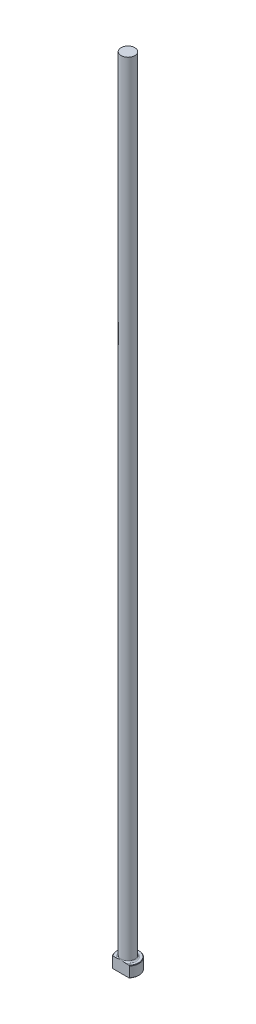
from build123d import *

# Parameters (mm, degrees)
CHAMFER1_SIZE = 0.254
FILLET1_R     = 0.762
KEY_DEPTH     = 458.28818594


with BuildPart() as part:
    # Sketch1 → Revolve1 (revolve)
    with BuildSketch(Plane.XY, mode=Mode.PRIVATE) as revolve1_sk:
        Polygon((0, 0), (-6.35, 0), (-6.35, 6.35), (-3.96875, 6.35), (-3.96875, 457.2), (0, 457.2), align=None)
    revolve(revolve1_sk.sketch.rotate(Axis((0, 259.958771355, 0), (0, -1, 0)), 270), axis=Axis((0, 259.958771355, 0), (0, -1, 0)))

    # Chamfer1
    chamfer1_edges = [part.edges().sort_by_distance(p)[0] for p in [
        (0, 6.35, -6.35),
        (0, 0, -6.35),
    ]]
    chamfer(chamfer1_edges, length=CHAMFER1_SIZE)

    # Fillet1
    fillet1_edges = [part.edges().sort_by_distance(p)[0] for p in [
        (0, 6.35, -3.96875),
    ]]
    fillet(fillet1_edges, radius=FILLET1_R)

    # Sketch2 → KEY (cut, through all)
    with BuildSketch(Plane.XZ):
        with BuildLine():
            Line((-4.956967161, 3.96875), (4.956967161, 3.96875))
            ThreePointArc((4.956967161, 3.96875), (0, 6.35), (-4.956967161, 3.96875))
        make_face()
    extrude(amount=-KEY_DEPTH, mode=Mode.SUBTRACT)


solid = part.part
